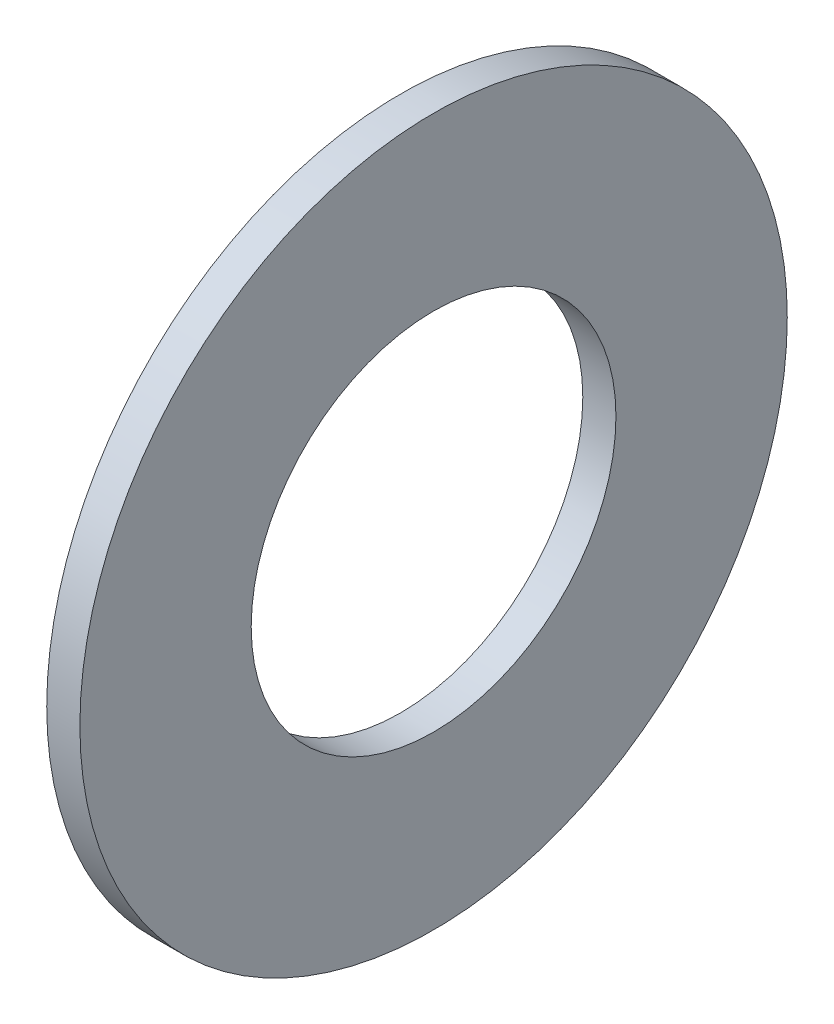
ISO-10303-21;
HEADER;
FILE_DESCRIPTION(('STEP AP214'),'2;1');
FILE_NAME('part.step','',(''),(''),'','','');
FILE_SCHEMA(('AUTOMOTIVE_DESIGN { 1 0 10303 214 1 1 1 1 }'));
ENDSEC;
DATA;
#1=APPLICATION_CONTEXT('core data for automotive mechanical design processes');
#2=APPLICATION_PROTOCOL_DEFINITION('international standard','automotive_design',2000,#1);
#3=PRODUCT_CONTEXT('',#1,'mechanical');
#4=PRODUCT('Part','Part','',(#3));
#5=PRODUCT_RELATED_PRODUCT_CATEGORY('part','',(#4));
#6=PRODUCT_DEFINITION_FORMATION('','',#4);
#7=PRODUCT_DEFINITION_CONTEXT('part definition',#1,'design');
#8=PRODUCT_DEFINITION('design','',#6,#7);
#9=PRODUCT_DEFINITION_SHAPE('','',#8);
#10=(LENGTH_UNIT() NAMED_UNIT(*) SI_UNIT(.MILLI.,.METRE.));
#11=(NAMED_UNIT(*) PLANE_ANGLE_UNIT() SI_UNIT($,.RADIAN.));
#12=(NAMED_UNIT(*) SI_UNIT($,.STERADIAN.) SOLID_ANGLE_UNIT());
#13=UNCERTAINTY_MEASURE_WITH_UNIT(LENGTH_MEASURE(1.E-05),#10,'distance_accuracy_value','');
#14=(GEOMETRIC_REPRESENTATION_CONTEXT(3) GLOBAL_UNCERTAINTY_ASSIGNED_CONTEXT((#13)) GLOBAL_UNIT_ASSIGNED_CONTEXT((#10,
#11,#12)) REPRESENTATION_CONTEXT('',''));
#15=CARTESIAN_POINT('',(0.,0.,0.));
#16=DIRECTION('',(0.,0.,1.));
#17=DIRECTION('',(1.,0.,0.));
#18=AXIS2_PLACEMENT_3D('',#15,#16,#17);
#19=CARTESIAN_POINT('',(1.5,16.,0.));
#20=DIRECTION('',(-1.,0.,0.));
#21=DIRECTION('',(0.,0.,1.));
#22=AXIS2_PLACEMENT_3D('',#19,#20,#21);
#23=PLANE('',#22);
#24=CARTESIAN_POINT('',(1.5,0.,0.));
#25=DIRECTION('',(-1.,0.,0.));
#26=DIRECTION('',(0.,0.,1.));
#27=AXIS2_PLACEMENT_3D('',#24,#25,#26);
#28=CIRCLE('',#27,8.25);
#29=CARTESIAN_POINT('',(1.5,0.,8.25));
#30=VERTEX_POINT('',#29);
#31=EDGE_CURVE('E17',#30,#30,#28,.T.);
#32=ORIENTED_EDGE('',*,*,#31,.T.);
#33=EDGE_LOOP('',(#32));
#34=FACE_BOUND('',#33,.T.);
#35=CARTESIAN_POINT('',(1.5,0.,0.));
#36=DIRECTION('',(-1.,0.,0.));
#37=DIRECTION('',(0.,0.,1.));
#38=AXIS2_PLACEMENT_3D('',#35,#36,#37);
#39=CIRCLE('',#38,16.);
#40=CARTESIAN_POINT('',(1.5,0.,16.));
#41=VERTEX_POINT('',#40);
#42=EDGE_CURVE('E26',#41,#41,#39,.T.);
#43=ORIENTED_EDGE('',*,*,#42,.F.);
#44=EDGE_LOOP('',(#43));
#45=FACE_BOUND('',#44,.T.);
#46=ADVANCED_FACE('F14',(#34,#45),#23,.F.);
#47=CARTESIAN_POINT('',(-9.15167813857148,0.,0.));
#48=DIRECTION('',(-1.,0.,0.));
#49=DIRECTION('',(0.,0.,1.));
#50=AXIS2_PLACEMENT_3D('',#47,#48,#49);
#51=CYLINDRICAL_SURFACE('',#50,8.25);
#52=ORIENTED_EDGE('',*,*,#31,.F.);
#53=EDGE_LOOP('',(#52));
#54=FACE_BOUND('',#53,.T.);
#55=CARTESIAN_POINT('',(0.,0.,0.));
#56=DIRECTION('',(-1.,0.,0.));
#57=DIRECTION('',(0.,0.,1.));
#58=AXIS2_PLACEMENT_3D('',#55,#56,#57);
#59=CIRCLE('',#58,8.25);
#60=CARTESIAN_POINT('',(0.,0.,8.25));
#61=VERTEX_POINT('',#60);
#62=EDGE_CURVE('E21',#61,#61,#59,.T.);
#63=ORIENTED_EDGE('',*,*,#62,.T.);
#64=EDGE_LOOP('',(#63));
#65=FACE_BOUND('',#64,.T.);
#66=ADVANCED_FACE('F36',(#54,#65),#51,.F.);
#67=CARTESIAN_POINT('',(-9.15167813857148,0.,0.));
#68=DIRECTION('',(-1.,0.,0.));
#69=DIRECTION('',(0.,0.,1.));
#70=AXIS2_PLACEMENT_3D('',#67,#68,#69);
#71=CYLINDRICAL_SURFACE('',#70,16.);
#72=CARTESIAN_POINT('',(0.,0.,0.));
#73=DIRECTION('',(-1.,0.,0.));
#74=DIRECTION('',(0.,0.,1.));
#75=AXIS2_PLACEMENT_3D('',#72,#73,#74);
#76=CIRCLE('',#75,16.);
#77=CARTESIAN_POINT('',(0.,0.,16.));
#78=VERTEX_POINT('',#77);
#79=EDGE_CURVE('E10',#78,#78,#76,.F.);
#80=ORIENTED_EDGE('',*,*,#79,.T.);
#81=EDGE_LOOP('',(#80));
#82=FACE_BOUND('',#81,.T.);
#83=ORIENTED_EDGE('',*,*,#42,.T.);
#84=EDGE_LOOP('',(#83));
#85=FACE_BOUND('',#84,.T.);
#86=ADVANCED_FACE('F39',(#82,#85),#71,.T.);
#87=CARTESIAN_POINT('',(0.,16.,0.));
#88=DIRECTION('',(1.,0.,0.));
#89=DIRECTION('',(0.,0.,-1.));
#90=AXIS2_PLACEMENT_3D('',#87,#88,#89);
#91=PLANE('',#90);
#92=ORIENTED_EDGE('',*,*,#79,.F.);
#93=EDGE_LOOP('',(#92));
#94=FACE_BOUND('',#93,.T.);
#95=ORIENTED_EDGE('',*,*,#62,.F.);
#96=EDGE_LOOP('',(#95));
#97=FACE_BOUND('',#96,.T.);
#98=ADVANCED_FACE('F42',(#94,#97),#91,.F.);
#99=CLOSED_SHELL('',(#46,#66,#86,#98));
#100=MANIFOLD_SOLID_BREP('B1',#99);
#101=ADVANCED_BREP_SHAPE_REPRESENTATION('',(#18,#100),#14);
#102=SHAPE_DEFINITION_REPRESENTATION(#9,#101);
ENDSEC;
END-ISO-10303-21;
